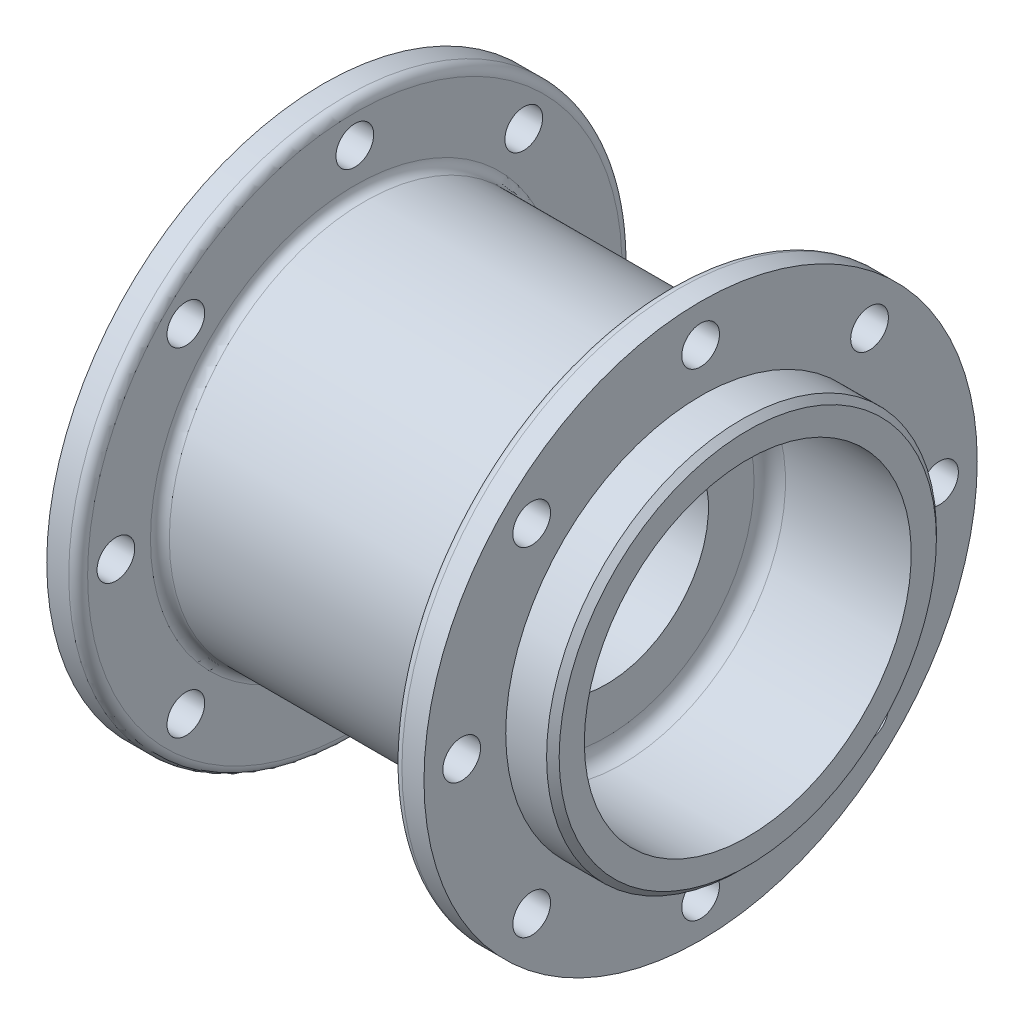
from build123d import *

# Parameters (mm, degrees)
CHANFREIN1_SIZE  = 2
CONG_1_R         = 3
ESQUISSE2_R      = 6
EXTRUSION1_DEPTH = 184.611001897
CONG_2_R         = 5


with BuildPart() as part:
    # Esquisse1 → R_volution1 (revolve)
    with BuildSketch(Plane.XY, mode=Mode.PRIVATE) as r_volution1_sk:
        Polygon((0, 62), (15, 62), (15, 88), (25, 88), (25, 62), (125, 62), (125, 88), (135, 88), (135, 62), (150, 62), (150, 52), (105, 52), (105, 32.5), (45, 32.5), (45, 52), (0, 52), align=None)
    revolve(r_volution1_sk.sketch.rotate(Axis((-29.137172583, 0, 0), (1, 0, 0)), 90), axis=Axis((-29.137172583, 0, 0), (1, 0, 0)))

    # Chanfrein1
    chanfrein1_edges = [part.edges().sort_by_distance(p)[0] for p in [
        (0, 0, -62),
        (150, 0, -62),
    ]]
    chamfer(chanfrein1_edges, length=CHANFREIN1_SIZE)

    # Cong_1
    cong_1_edges = [part.edges().sort_by_distance(p)[0] for p in [
        (25, 0, -88),
        (25, 0, -62),
        (125, 0, -62),
        (125, 0, -88),
    ]]
    fillet(cong_1_edges, radius=CONG_1_R)

    # Esquisse2 → Extrusion1 (cut, through all)
    with BuildSketch(Plane.ZY.offset(-15)):
        with Locations((-53.74011537, 53.74011537)):
            Circle(ESQUISSE2_R)
        with Locations((0, 76)):
            Circle(ESQUISSE2_R)
        with Locations((53.74011537, 53.74011537)):
            Circle(ESQUISSE2_R)
        with Locations((76, 0)):
            Circle(ESQUISSE2_R)
        with Locations((53.74011537, -53.74011537)):
            Circle(ESQUISSE2_R)
        with Locations((0, -76)):
            Circle(ESQUISSE2_R)
        with Locations((-53.74011537, -53.74011537)):
            Circle(ESQUISSE2_R)
        with Locations((-76, 0)):
            Circle(ESQUISSE2_R)
    extrude(amount=-EXTRUSION1_DEPTH, mode=Mode.SUBTRACT)

    # Cong_2
    cong_2_edges = [part.edges().sort_by_distance(p)[0] for p in [
        (105, 0, -52),
        (45, 0, -52),
    ]]
    fillet(cong_2_edges, radius=CONG_2_R)


solid = part.part
